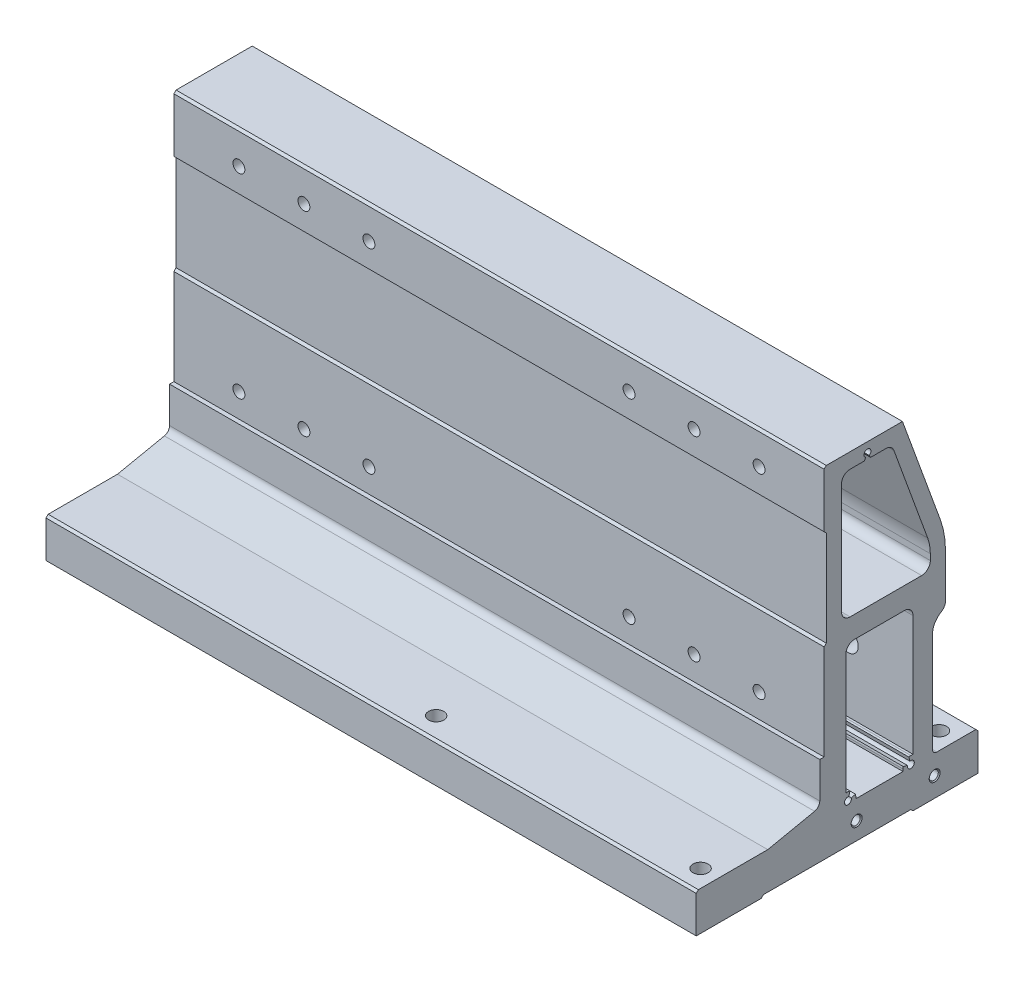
from build123d import *

# Parameters (mm, degrees)
EXTRUDE_1_DEPTH                = 150
HOLE_WIZARD_M5_1_D             = 5.5
HOLE_WIZARD_M5_1_CBORE_D       = 9.5
HOLE_WIZARD_M5_1_CBORE_DEPTH   = 49
PATTERN_LINEAR_1_COUNT         = 2
PATTERN_LINEAR_1_PITCH         = 180
HOLE_WIZARD_M5_1_2_D           = 4.2
HOLE_WIZARD_M5_1_2_DEPTH       = 12
HOLE_WIZARD_M5_1_2_CSINK_D     = 5.05
HOLE_WIZARD_M5_1_2_CSINK_ANGLE = 90
HOLE_WIZARD_M5_1_2_TIP         = 1.2618073
F_5_0MM_1_D                    = 5
F_5_0MM_1_DEPTH                = 10
F_5_0MM_1_TIP                  = 1.502151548
HOLE_WIZARD_7_0_7_1_D          = 7


with BuildPart() as part:
    # Sketch 1 → Extrude 1 (new, symmetric)
    with BuildSketch(Plane(origin=(0, 0, 0), x_dir=(0, 0, -1), z_dir=(1, 0, 0))):
        with BuildLine():
            Line((-5, 156.999997), (-6, 155.999997))
            Line((-6, 155.999997), (-6, 131))
            Line((-6, 131), (-5, 130))
            Line((-5, 130), (-5, 86))
            Line((-5, 86), (-6, 85))
            Line((-6, 85), (-6, 40.999831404))
            Line((-6, 40.999831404), (-8, 40.999831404))
            Line((-8, 40.999831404), (-8, 24.439412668))
            ThreePointArc((-8, 24.439412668), (-8.672384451, 22.546741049), (-10.388137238, 21.502471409))
            Line((-10.388137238, 21.502471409), (-32, 17))
            Line((-32, 17), (-64, 17))
            Line((-64, 17), (-65, 16))
            Line((-65, 16), (-65, -1))
            Line((-65, -1), (-35, -1))
            Line((-35, -1), (-34, 0))
            Line((-34, 0), (34, 0))
            Line((34, 0), (35, -1))
            Line((35, -1), (65, -1))
            Line((65, -1), (65, 16))
            Line((65, 16), (64, 17))
            Line((64, 17), (46, 17))
            ThreePointArc((46, 17), (44.585786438, 17.585786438), (44, 19))
            Line((44, 19), (44, 65))
            ThreePointArc((44, 65), (45.07179677, 69), (48, 71.92820323))
            ThreePointArc((48, 71.92820323), (49.464101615, 73.392304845), (50, 75.392304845))
            Line((50, 75.392304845), (50, 95.442037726))
            ThreePointArc((50, 95.442037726), (49.391487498, 102.392628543), (47.584464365, 109.131743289))
            Line((47.584464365, 109.131743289), (30.149007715, 156.999997))
            Line((30.149007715, 156.999997), (-5, 156.999997))
        make_face()
        with BuildLine():
            Line((2, 95), (2, 146))
            ThreePointArc((2, 146), (3.171572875, 148.828427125), (6, 150))
            Line((6, 150), (12.556626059, 150))
            Line((12.556626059, 150), (13.2, 151.114356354))
            ThreePointArc((13.2, 151.114356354), (14, 154.099997), (14.8, 151.114356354))
            Line((14.8, 151.114356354), (15.443373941, 150))
            Line((15.443373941, 150), (22.448664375, 150))
            ThreePointArc((22.448664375, 150), (24.742582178, 149.276879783), (26.207110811, 147.368970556))
            Line((26.207110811, 147.368970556), (41.792232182, 104.580728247))
            ThreePointArc((41.792232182, 104.580728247), (42.695743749, 101.211170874), (43, 97.735875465))
            Line((43, 97.735875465), (43, 95))
            ThreePointArc((43, 95), (41.828427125, 92.171572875), (39, 91))
            Line((39, 91), (6, 91))
            ThreePointArc((6, 91), (3.171572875, 92.171572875), (2, 95))
        make_face(mode=Mode.SUBTRACT)
        with BuildLine():
            Line((8, 81), (31, 81))
            ThreePointArc((31, 81), (33.828427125, 79.828427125), (35, 77))
            Line((35, 77), (35, 21.6))
            Line((35, 21.6), (34, 21.6))
            ThreePointArc((34, 21.6), (33.530105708, 21.569201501), (33.068251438, 21.477332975))
            Line((33.068251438, 21.477332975), (33.585889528, 19.545481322))
            ThreePointArc((33.585889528, 19.545481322), (35.13137085, 16.86862915), (32.454518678, 18.414110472))
            Line((32.454518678, 18.414110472), (30.522667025, 18.931748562))
            ThreePointArc((30.522667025, 18.931748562), (30.430798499, 18.469894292), (30.4, 18))
            Line((30.4, 18), (30.4, 17))
            Line((30.4, 17), (8.6, 17))
            Line((8.6, 17), (8.6, 18))
            ThreePointArc((8.6, 18), (8.569201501, 18.469894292), (8.477332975, 18.931748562))
            Line((8.477332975, 18.931748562), (6.545481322, 18.414110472))
            ThreePointArc((6.545481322, 18.414110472), (3.86862915, 16.86862915), (5.414110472, 19.545481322))
            Line((5.414110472, 19.545481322), (5.931748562, 21.477332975))
            ThreePointArc((5.931748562, 21.477332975), (5.469894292, 21.569201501), (5, 21.6))
            Line((5, 21.6), (4, 21.6))
            Line((4, 21.6), (4, 77))
            ThreePointArc((4, 77), (5.171572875, 79.828427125), (8, 81))
        make_face(mode=Mode.SUBTRACT)
    extrude(amount=EXTRUDE_1_DEPTH, both=True)

    # Hole Wizard M5 _ _ _ _ _1 (through all)
    with Locations(Plane(origin=(0, 0, -50), x_dir=(-1, 0, 0), z_dir=(0, 0, -1))):
        with Locations((-120, 142), (-90, 142), (-60, 142), (-120, 52), (-90, 52), (-60, 52)):
            hole_wizard_m5_1 = CounterBoreHole(HOLE_WIZARD_M5_1_D / 2, HOLE_WIZARD_M5_1_CBORE_D / 2, HOLE_WIZARD_M5_1_CBORE_DEPTH)

    # Pattern Linear 1: Hole Wizard M5 _ _ _ _ _1 ×2
    with Locations(*[(-i * PATTERN_LINEAR_1_PITCH, 0, 0) for i in range(1, PATTERN_LINEAR_1_COUNT)]):
        add(hole_wizard_m5_1, mode=Mode.SUBTRACT)

    # Hole Wizard M5 _ _1 2
    with Locations(Plane(origin=(150, 0, 0), x_dir=(0, 0, -1), z_dir=(1, 0, 0))):
        with Locations((45, 8), (9, 8)):
            CounterSinkHole(HOLE_WIZARD_M5_1_2_D / 2, HOLE_WIZARD_M5_1_2_CSINK_D / 2, depth=HOLE_WIZARD_M5_1_2_DEPTH, counter_sink_angle=HOLE_WIZARD_M5_1_2_CSINK_ANGLE)
            with Locations((0, 0, -(HOLE_WIZARD_M5_1_2_DEPTH + HOLE_WIZARD_M5_1_2_TIP / 2))):  # 118° drill point
                Cone(0, HOLE_WIZARD_M5_1_2_D / 2, HOLE_WIZARD_M5_1_2_TIP, mode=Mode.SUBTRACT)

    # 5.0mm _ _1
    with Locations(Plane(origin=(0, 0, 0), x_dir=(-1, 0, 0), z_dir=(0, -1, 0))):
        with Locations((-20, 0), (-142, 0)):
            Hole(F_5_0MM_1_D / 2, depth=F_5_0MM_1_DEPTH)
            with Locations((0, 0, -(F_5_0MM_1_DEPTH + F_5_0MM_1_TIP / 2))):  # 118° drill point
                Cone(0, F_5_0MM_1_D / 2, F_5_0MM_1_TIP, mode=Mode.SUBTRACT)

    # Hole Wizard 7.0 _7_ _ _1 (through all)
    with Locations(Plane(origin=(0, -1, 0), x_dir=(-1, 0, 0), z_dir=(0, -1, 0))):
        with Locations((-142, -55), (-20, -55), (-20, 55), (-142, 55)):
            Hole(HOLE_WIZARD_7_0_7_1_D / 2)


solid = part.part
